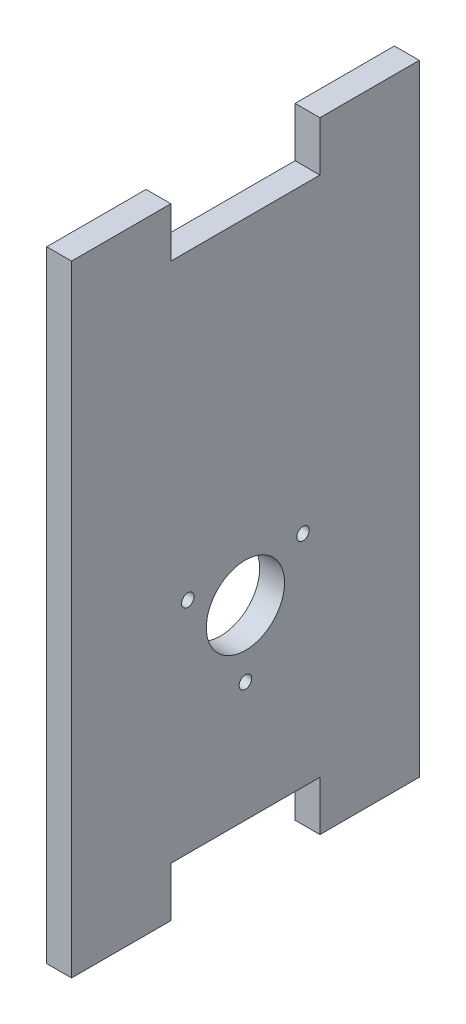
ISO-10303-21;
HEADER;
FILE_DESCRIPTION(('STEP AP214'),'2;1');
FILE_NAME('part.step','',(''),(''),'','','');
FILE_SCHEMA(('AUTOMOTIVE_DESIGN { 1 0 10303 214 1 1 1 1 }'));
ENDSEC;
DATA;
#1=APPLICATION_CONTEXT('core data for automotive mechanical design processes');
#2=APPLICATION_PROTOCOL_DEFINITION('international standard','automotive_design',2000,#1);
#3=PRODUCT_CONTEXT('',#1,'mechanical');
#4=PRODUCT('Part','Part','',(#3));
#5=PRODUCT_RELATED_PRODUCT_CATEGORY('part','',(#4));
#6=PRODUCT_DEFINITION_FORMATION('','',#4);
#7=PRODUCT_DEFINITION_CONTEXT('part definition',#1,'design');
#8=PRODUCT_DEFINITION('design','',#6,#7);
#9=PRODUCT_DEFINITION_SHAPE('','',#8);
#10=(LENGTH_UNIT() NAMED_UNIT(*) SI_UNIT(.MILLI.,.METRE.));
#11=(NAMED_UNIT(*) PLANE_ANGLE_UNIT() SI_UNIT($,.RADIAN.));
#12=(NAMED_UNIT(*) SI_UNIT($,.STERADIAN.) SOLID_ANGLE_UNIT());
#13=UNCERTAINTY_MEASURE_WITH_UNIT(LENGTH_MEASURE(1.E-05),#10,'distance_accuracy_value','');
#14=(GEOMETRIC_REPRESENTATION_CONTEXT(3) GLOBAL_UNCERTAINTY_ASSIGNED_CONTEXT((#13)) GLOBAL_UNIT_ASSIGNED_CONTEXT((#10,
#11,#12)) REPRESENTATION_CONTEXT('',''));
#15=CARTESIAN_POINT('',(0.,0.,0.));
#16=DIRECTION('',(0.,0.,1.));
#17=DIRECTION('',(1.,0.,0.));
#18=AXIS2_PLACEMENT_3D('',#15,#16,#17);
#19=CARTESIAN_POINT('',(3.175,-6.35,22.225));
#20=DIRECTION('',(-1.,0.,0.));
#21=DIRECTION('',(0.,0.,1.));
#22=AXIS2_PLACEMENT_3D('',#19,#20,#21);
#23=PLANE('',#22);
#24=CARTESIAN_POINT('',(3.175,28.0625,7.36121593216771));
#25=DIRECTION('',(1.,0.,0.));
#26=DIRECTION('',(0.,0.,-1.));
#27=AXIS2_PLACEMENT_3D('',#24,#25,#26);
#28=CIRCLE('',#27,0.800000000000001);
#29=CARTESIAN_POINT('',(3.175,28.0625,6.56121593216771));
#30=VERTEX_POINT('',#29);
#31=EDGE_CURVE('E290',#30,#30,#28,.T.);
#32=ORIENTED_EDGE('',*,*,#31,.F.);
#33=EDGE_LOOP('',(#32));
#34=FACE_BOUND('',#33,.T.);
#35=CARTESIAN_POINT('',(3.175,23.8125,0.));
#36=DIRECTION('',(1.,0.,0.));
#37=DIRECTION('',(0.,0.,-1.));
#38=AXIS2_PLACEMENT_3D('',#35,#36,#37);
#39=CIRCLE('',#38,5.);
#40=CARTESIAN_POINT('',(3.175,23.8125,-5.));
#41=VERTEX_POINT('',#40);
#42=EDGE_CURVE('E156',#41,#41,#39,.T.);
#43=ORIENTED_EDGE('',*,*,#42,.F.);
#44=EDGE_LOOP('',(#43));
#45=FACE_BOUND('',#44,.T.);
#46=DIRECTION('',(0.,-1.,0.));
#47=VECTOR('',#46,1.);
#48=CARTESIAN_POINT('',(3.175,73.025,22.225));
#49=LINE('',#48,#47);
#50=CARTESIAN_POINT('',(3.175,73.025,22.225));
#51=VERTEX_POINT('',#50);
#52=CARTESIAN_POINT('',(3.175,-6.35,22.225));
#53=VERTEX_POINT('',#52);
#54=EDGE_CURVE('E175',#51,#53,#49,.T.);
#55=ORIENTED_EDGE('',*,*,#54,.T.);
#56=DIRECTION('',(0.,0.,-1.));
#57=VECTOR('',#56,1.);
#58=CARTESIAN_POINT('',(3.175,-6.35,9.525));
#59=LINE('',#58,#57);
#60=CARTESIAN_POINT('',(3.175,-6.35,9.525));
#61=VERTEX_POINT('',#60);
#62=EDGE_CURVE('E103',#53,#61,#59,.T.);
#63=ORIENTED_EDGE('',*,*,#62,.T.);
#64=DIRECTION('',(0.,1.,0.));
#65=VECTOR('',#64,1.);
#66=CARTESIAN_POINT('',(3.175,0.,9.525));
#67=LINE('',#66,#65);
#68=CARTESIAN_POINT('',(3.175,0.,9.525));
#69=VERTEX_POINT('',#68);
#70=EDGE_CURVE('E202',#61,#69,#67,.T.);
#71=ORIENTED_EDGE('',*,*,#70,.T.);
#72=DIRECTION('',(0.,0.,-1.));
#73=VECTOR('',#72,1.);
#74=CARTESIAN_POINT('',(3.175,0.,9.525));
#75=LINE('',#74,#73);
#76=CARTESIAN_POINT('',(3.175,0.,-9.525));
#77=VERTEX_POINT('',#76);
#78=EDGE_CURVE('E221',#69,#77,#75,.T.);
#79=ORIENTED_EDGE('',*,*,#78,.T.);
#80=DIRECTION('',(0.,-1.,0.));
#81=VECTOR('',#80,1.);
#82=CARTESIAN_POINT('',(3.175,0.,-9.525));
#83=LINE('',#82,#81);
#84=CARTESIAN_POINT('',(3.175,-6.35,-9.525));
#85=VERTEX_POINT('',#84);
#86=EDGE_CURVE('E218',#77,#85,#83,.T.);
#87=ORIENTED_EDGE('',*,*,#86,.T.);
#88=DIRECTION('',(0.,0.,-1.));
#89=VECTOR('',#88,1.);
#90=CARTESIAN_POINT('',(3.175,-6.35,-9.525));
#91=LINE('',#90,#89);
#92=CARTESIAN_POINT('',(3.175,-6.35,-22.225));
#93=VERTEX_POINT('',#92);
#94=EDGE_CURVE('E220',#85,#93,#91,.T.);
#95=ORIENTED_EDGE('',*,*,#94,.T.);
#96=DIRECTION('',(0.,1.,0.));
#97=VECTOR('',#96,1.);
#98=CARTESIAN_POINT('',(3.175,73.025,-22.225));
#99=LINE('',#98,#97);
#100=CARTESIAN_POINT('',(3.175,73.025,-22.225));
#101=VERTEX_POINT('',#100);
#102=EDGE_CURVE('E223',#93,#101,#99,.T.);
#103=ORIENTED_EDGE('',*,*,#102,.T.);
#104=DIRECTION('',(0.,0.,1.));
#105=VECTOR('',#104,1.);
#106=CARTESIAN_POINT('',(3.175,73.025,-22.225));
#107=LINE('',#106,#105);
#108=CARTESIAN_POINT('',(3.175,73.025,-9.52500000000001));
#109=VERTEX_POINT('',#108);
#110=EDGE_CURVE('E229',#101,#109,#107,.T.);
#111=ORIENTED_EDGE('',*,*,#110,.T.);
#112=DIRECTION('',(0.,-1.,0.));
#113=VECTOR('',#112,1.);
#114=CARTESIAN_POINT('',(3.175,73.025,-9.52500000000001));
#115=LINE('',#114,#113);
#116=CARTESIAN_POINT('',(3.175,66.675,-9.52500000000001));
#117=VERTEX_POINT('',#116);
#118=EDGE_CURVE('E134',#109,#117,#115,.T.);
#119=ORIENTED_EDGE('',*,*,#118,.T.);
#120=DIRECTION('',(0.,0.,1.));
#121=VECTOR('',#120,1.);
#122=CARTESIAN_POINT('',(3.175,66.675,9.52500000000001));
#123=LINE('',#122,#121);
#124=CARTESIAN_POINT('',(3.175,66.675,9.52500000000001));
#125=VERTEX_POINT('',#124);
#126=EDGE_CURVE('E128',#117,#125,#123,.T.);
#127=ORIENTED_EDGE('',*,*,#126,.T.);
#128=DIRECTION('',(0.,1.,0.));
#129=VECTOR('',#128,1.);
#130=CARTESIAN_POINT('',(3.175,73.025,9.52500000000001));
#131=LINE('',#130,#129);
#132=CARTESIAN_POINT('',(3.175,73.025,9.52500000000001));
#133=VERTEX_POINT('',#132);
#134=EDGE_CURVE('E132',#125,#133,#131,.T.);
#135=ORIENTED_EDGE('',*,*,#134,.T.);
#136=DIRECTION('',(0.,0.,1.));
#137=VECTOR('',#136,1.);
#138=CARTESIAN_POINT('',(3.175,73.025,22.225));
#139=LINE('',#138,#137);
#140=EDGE_CURVE('E48',#133,#51,#139,.T.);
#141=ORIENTED_EDGE('',*,*,#140,.T.);
#142=EDGE_LOOP('',(#55,#63,#71,#79,#87,#95,#103,#111,#119,#127,#135,#141));
#143=FACE_BOUND('',#142,.T.);
#144=CARTESIAN_POINT('',(3.175,15.3125,0.));
#145=DIRECTION('',(1.,0.,0.));
#146=DIRECTION('',(0.,0.,-1.));
#147=AXIS2_PLACEMENT_3D('',#144,#145,#146);
#148=CIRCLE('',#147,0.8);
#149=CARTESIAN_POINT('',(3.175,15.3125,-0.8));
#150=VERTEX_POINT('',#149);
#151=EDGE_CURVE('E296',#150,#150,#148,.T.);
#152=ORIENTED_EDGE('',*,*,#151,.F.);
#153=EDGE_LOOP('',(#152));
#154=FACE_BOUND('',#153,.T.);
#155=CARTESIAN_POINT('',(3.175,28.0624999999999,-7.36121593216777));
#156=DIRECTION('',(1.,0.,0.));
#157=DIRECTION('',(0.,0.,-1.));
#158=AXIS2_PLACEMENT_3D('',#155,#156,#157);
#159=CIRCLE('',#158,0.800000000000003);
#160=CARTESIAN_POINT('',(3.175,28.0624999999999,-8.16121593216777));
#161=VERTEX_POINT('',#160);
#162=EDGE_CURVE('E281',#161,#161,#159,.T.);
#163=ORIENTED_EDGE('',*,*,#162,.F.);
#164=EDGE_LOOP('',(#163));
#165=FACE_BOUND('',#164,.T.);
#166=ADVANCED_FACE('F31',(#34,#45,#143,#154,#165),#23,.F.);
#167=CARTESIAN_POINT('',(0.,-6.35,22.225));
#168=DIRECTION('',(-1.,0.,0.));
#169=DIRECTION('',(0.,0.,1.));
#170=AXIS2_PLACEMENT_3D('',#167,#168,#169);
#171=PLANE('',#170);
#172=CARTESIAN_POINT('',(0.,28.0625,7.36121593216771));
#173=DIRECTION('',(1.,0.,0.));
#174=DIRECTION('',(0.,0.,-1.));
#175=AXIS2_PLACEMENT_3D('',#172,#173,#174);
#176=CIRCLE('',#175,0.800000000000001);
#177=CARTESIAN_POINT('',(0.,28.0625,6.56121593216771));
#178=VERTEX_POINT('',#177);
#179=EDGE_CURVE('E287',#178,#178,#176,.T.);
#180=ORIENTED_EDGE('',*,*,#179,.T.);
#181=EDGE_LOOP('',(#180));
#182=FACE_BOUND('',#181,.T.);
#183=CARTESIAN_POINT('',(0.,23.8125,0.));
#184=DIRECTION('',(1.,0.,0.));
#185=DIRECTION('',(0.,0.,-1.));
#186=AXIS2_PLACEMENT_3D('',#183,#184,#185);
#187=CIRCLE('',#186,5.);
#188=CARTESIAN_POINT('',(0.,23.8125,-5.));
#189=VERTEX_POINT('',#188);
#190=EDGE_CURVE('E299',#189,#189,#187,.T.);
#191=ORIENTED_EDGE('',*,*,#190,.T.);
#192=EDGE_LOOP('',(#191));
#193=FACE_BOUND('',#192,.T.);
#194=DIRECTION('',(0.,-1.,0.));
#195=VECTOR('',#194,1.);
#196=CARTESIAN_POINT('',(0.,73.025,22.225));
#197=LINE('',#196,#195);
#198=CARTESIAN_POINT('',(0.,73.025,22.225));
#199=VERTEX_POINT('',#198);
#200=CARTESIAN_POINT('',(0.,-6.35,22.225));
#201=VERTEX_POINT('',#200);
#202=EDGE_CURVE('E152',#199,#201,#197,.T.);
#203=ORIENTED_EDGE('',*,*,#202,.F.);
#204=DIRECTION('',(0.,0.,1.));
#205=VECTOR('',#204,1.);
#206=CARTESIAN_POINT('',(0.,73.025,22.225));
#207=LINE('',#206,#205);
#208=CARTESIAN_POINT('',(0.,73.025,9.52500000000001));
#209=VERTEX_POINT('',#208);
#210=EDGE_CURVE('E95',#209,#199,#207,.T.);
#211=ORIENTED_EDGE('',*,*,#210,.F.);
#212=DIRECTION('',(0.,1.,0.));
#213=VECTOR('',#212,1.);
#214=CARTESIAN_POINT('',(0.,73.025,9.52500000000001));
#215=LINE('',#214,#213);
#216=CARTESIAN_POINT('',(0.,66.675,9.52500000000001));
#217=VERTEX_POINT('',#216);
#218=EDGE_CURVE('E89',#217,#209,#215,.T.);
#219=ORIENTED_EDGE('',*,*,#218,.F.);
#220=DIRECTION('',(0.,0.,1.));
#221=VECTOR('',#220,1.);
#222=CARTESIAN_POINT('',(0.,66.675,9.52500000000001));
#223=LINE('',#222,#221);
#224=CARTESIAN_POINT('',(0.,66.675,-9.52500000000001));
#225=VERTEX_POINT('',#224);
#226=EDGE_CURVE('E142',#225,#217,#223,.T.);
#227=ORIENTED_EDGE('',*,*,#226,.F.);
#228=DIRECTION('',(0.,-1.,0.));
#229=VECTOR('',#228,1.);
#230=CARTESIAN_POINT('',(0.,73.025,-9.52500000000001));
#231=LINE('',#230,#229);
#232=CARTESIAN_POINT('',(0.,73.025,-9.52500000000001));
#233=VERTEX_POINT('',#232);
#234=EDGE_CURVE('E170',#233,#225,#231,.T.);
#235=ORIENTED_EDGE('',*,*,#234,.F.);
#236=DIRECTION('',(0.,0.,1.));
#237=VECTOR('',#236,1.);
#238=CARTESIAN_POINT('',(0.,73.025,-22.225));
#239=LINE('',#238,#237);
#240=CARTESIAN_POINT('',(0.,73.025,-22.225));
#241=VERTEX_POINT('',#240);
#242=EDGE_CURVE('E168',#241,#233,#239,.T.);
#243=ORIENTED_EDGE('',*,*,#242,.F.);
#244=DIRECTION('',(0.,1.,0.));
#245=VECTOR('',#244,1.);
#246=CARTESIAN_POINT('',(0.,73.025,-22.225));
#247=LINE('',#246,#245);
#248=CARTESIAN_POINT('',(0.,-6.35,-22.225));
#249=VERTEX_POINT('',#248);
#250=EDGE_CURVE('E166',#249,#241,#247,.T.);
#251=ORIENTED_EDGE('',*,*,#250,.F.);
#252=DIRECTION('',(0.,0.,-1.));
#253=VECTOR('',#252,1.);
#254=CARTESIAN_POINT('',(0.,-6.35,-9.525));
#255=LINE('',#254,#253);
#256=CARTESIAN_POINT('',(0.,-6.35,-9.525));
#257=VERTEX_POINT('',#256);
#258=EDGE_CURVE('E164',#257,#249,#255,.T.);
#259=ORIENTED_EDGE('',*,*,#258,.F.);
#260=DIRECTION('',(0.,-1.,0.));
#261=VECTOR('',#260,1.);
#262=CARTESIAN_POINT('',(0.,0.,-9.525));
#263=LINE('',#262,#261);
#264=CARTESIAN_POINT('',(0.,0.,-9.525));
#265=VERTEX_POINT('',#264);
#266=EDGE_CURVE('E162',#265,#257,#263,.T.);
#267=ORIENTED_EDGE('',*,*,#266,.F.);
#268=DIRECTION('',(0.,0.,-1.));
#269=VECTOR('',#268,1.);
#270=CARTESIAN_POINT('',(0.,0.,9.525));
#271=LINE('',#270,#269);
#272=CARTESIAN_POINT('',(0.,0.,9.525));
#273=VERTEX_POINT('',#272);
#274=EDGE_CURVE('E160',#273,#265,#271,.T.);
#275=ORIENTED_EDGE('',*,*,#274,.F.);
#276=DIRECTION('',(0.,1.,0.));
#277=VECTOR('',#276,1.);
#278=CARTESIAN_POINT('',(0.,0.,9.525));
#279=LINE('',#278,#277);
#280=CARTESIAN_POINT('',(0.,-6.35,9.525));
#281=VERTEX_POINT('',#280);
#282=EDGE_CURVE('E158',#281,#273,#279,.T.);
#283=ORIENTED_EDGE('',*,*,#282,.F.);
#284=DIRECTION('',(0.,0.,-1.));
#285=VECTOR('',#284,1.);
#286=CARTESIAN_POINT('',(0.,-6.35,9.525));
#287=LINE('',#286,#285);
#288=EDGE_CURVE('E155',#201,#281,#287,.T.);
#289=ORIENTED_EDGE('',*,*,#288,.F.);
#290=EDGE_LOOP('',(#203,#211,#219,#227,#235,#243,#251,#259,#267,#275,#283,#289));
#291=FACE_BOUND('',#290,.T.);
#292=CARTESIAN_POINT('',(0.,15.3125,0.));
#293=DIRECTION('',(1.,0.,0.));
#294=DIRECTION('',(0.,0.,-1.));
#295=AXIS2_PLACEMENT_3D('',#292,#293,#294);
#296=CIRCLE('',#295,0.8);
#297=CARTESIAN_POINT('',(0.,15.3125,-0.8));
#298=VERTEX_POINT('',#297);
#299=EDGE_CURVE('E293',#298,#298,#296,.T.);
#300=ORIENTED_EDGE('',*,*,#299,.T.);
#301=EDGE_LOOP('',(#300));
#302=FACE_BOUND('',#301,.T.);
#303=CARTESIAN_POINT('',(0.,28.0624999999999,-7.36121593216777));
#304=DIRECTION('',(1.,0.,0.));
#305=DIRECTION('',(0.,0.,-1.));
#306=AXIS2_PLACEMENT_3D('',#303,#304,#305);
#307=CIRCLE('',#306,0.800000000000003);
#308=CARTESIAN_POINT('',(0.,28.0624999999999,-8.16121593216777));
#309=VERTEX_POINT('',#308);
#310=EDGE_CURVE('E284',#309,#309,#307,.T.);
#311=ORIENTED_EDGE('',*,*,#310,.T.);
#312=EDGE_LOOP('',(#311));
#313=FACE_BOUND('',#312,.T.);
#314=ADVANCED_FACE('F206',(#182,#193,#291,#302,#313),#171,.T.);
#315=CARTESIAN_POINT('',(3.175,73.025,22.225));
#316=DIRECTION('',(0.,0.,-1.));
#317=DIRECTION('',(0.,1.,0.));
#318=AXIS2_PLACEMENT_3D('',#315,#316,#317);
#319=PLANE('',#318);
#320=ORIENTED_EDGE('',*,*,#202,.T.);
#321=DIRECTION('',(-1.,0.,0.));
#322=VECTOR('',#321,1.);
#323=CARTESIAN_POINT('',(3.175,-6.35,22.225));
#324=LINE('',#323,#322);
#325=EDGE_CURVE('E11',#53,#201,#324,.T.);
#326=ORIENTED_EDGE('',*,*,#325,.F.);
#327=ORIENTED_EDGE('',*,*,#54,.F.);
#328=DIRECTION('',(-1.,0.,0.));
#329=VECTOR('',#328,1.);
#330=CARTESIAN_POINT('',(3.175,73.025,22.225));
#331=LINE('',#330,#329);
#332=EDGE_CURVE('E148',#51,#199,#331,.T.);
#333=ORIENTED_EDGE('',*,*,#332,.T.);
#334=EDGE_LOOP('',(#320,#326,#327,#333));
#335=FACE_BOUND('',#334,.T.);
#336=ADVANCED_FACE('F33',(#335),#319,.F.);
#337=CARTESIAN_POINT('',(3.175,-6.35,9.525));
#338=DIRECTION('',(0.,1.,0.));
#339=DIRECTION('',(0.,0.,1.));
#340=AXIS2_PLACEMENT_3D('',#337,#338,#339);
#341=PLANE('',#340);
#342=ORIENTED_EDGE('',*,*,#288,.T.);
#343=DIRECTION('',(-1.,0.,0.));
#344=VECTOR('',#343,1.);
#345=CARTESIAN_POINT('',(3.175,-6.35,9.525));
#346=LINE('',#345,#344);
#347=EDGE_CURVE('E40',#61,#281,#346,.T.);
#348=ORIENTED_EDGE('',*,*,#347,.F.);
#349=ORIENTED_EDGE('',*,*,#62,.F.);
#350=ORIENTED_EDGE('',*,*,#325,.T.);
#351=EDGE_LOOP('',(#342,#348,#349,#350));
#352=FACE_BOUND('',#351,.T.);
#353=ADVANCED_FACE('F408',(#352),#341,.F.);
#354=CARTESIAN_POINT('',(3.175,0.,9.525));
#355=DIRECTION('',(0.,0.,1.));
#356=DIRECTION('',(1.,0.,0.));
#357=AXIS2_PLACEMENT_3D('',#354,#355,#356);
#358=PLANE('',#357);
#359=ORIENTED_EDGE('',*,*,#282,.T.);
#360=DIRECTION('',(-1.,0.,0.));
#361=VECTOR('',#360,1.);
#362=CARTESIAN_POINT('',(3.175,0.,9.525));
#363=LINE('',#362,#361);
#364=EDGE_CURVE('E194',#69,#273,#363,.T.);
#365=ORIENTED_EDGE('',*,*,#364,.F.);
#366=ORIENTED_EDGE('',*,*,#70,.F.);
#367=ORIENTED_EDGE('',*,*,#347,.T.);
#368=EDGE_LOOP('',(#359,#365,#366,#367));
#369=FACE_BOUND('',#368,.T.);
#370=ADVANCED_FACE('F200',(#369),#358,.F.);
#371=CARTESIAN_POINT('',(3.175,0.,9.525));
#372=DIRECTION('',(0.,1.,0.));
#373=DIRECTION('',(0.,0.,1.));
#374=AXIS2_PLACEMENT_3D('',#371,#372,#373);
#375=PLANE('',#374);
#376=ORIENTED_EDGE('',*,*,#274,.T.);
#377=DIRECTION('',(-1.,0.,0.));
#378=VECTOR('',#377,1.);
#379=CARTESIAN_POINT('',(3.175,0.,-9.525));
#380=LINE('',#379,#378);
#381=EDGE_CURVE('E191',#77,#265,#380,.T.);
#382=ORIENTED_EDGE('',*,*,#381,.F.);
#383=ORIENTED_EDGE('',*,*,#78,.F.);
#384=ORIENTED_EDGE('',*,*,#364,.T.);
#385=EDGE_LOOP('',(#376,#382,#383,#384));
#386=FACE_BOUND('',#385,.T.);
#387=ADVANCED_FACE('F212',(#386),#375,.F.);
#388=CARTESIAN_POINT('',(3.175,0.,-9.525));
#389=DIRECTION('',(0.,0.,-1.));
#390=DIRECTION('',(-1.,0.,0.));
#391=AXIS2_PLACEMENT_3D('',#388,#389,#390);
#392=PLANE('',#391);
#393=ORIENTED_EDGE('',*,*,#266,.T.);
#394=DIRECTION('',(-1.,0.,0.));
#395=VECTOR('',#394,1.);
#396=CARTESIAN_POINT('',(3.175,-6.35,-9.525));
#397=LINE('',#396,#395);
#398=EDGE_CURVE('E188',#85,#257,#397,.T.);
#399=ORIENTED_EDGE('',*,*,#398,.F.);
#400=ORIENTED_EDGE('',*,*,#86,.F.);
#401=ORIENTED_EDGE('',*,*,#381,.T.);
#402=EDGE_LOOP('',(#393,#399,#400,#401));
#403=FACE_BOUND('',#402,.T.);
#404=ADVANCED_FACE('F216',(#403),#392,.F.);
#405=CARTESIAN_POINT('',(3.175,-6.35,-9.525));
#406=DIRECTION('',(0.,1.,0.));
#407=DIRECTION('',(0.,0.,1.));
#408=AXIS2_PLACEMENT_3D('',#405,#406,#407);
#409=PLANE('',#408);
#410=ORIENTED_EDGE('',*,*,#258,.T.);
#411=DIRECTION('',(-1.,0.,0.));
#412=VECTOR('',#411,1.);
#413=CARTESIAN_POINT('',(3.175,-6.35,-22.225));
#414=LINE('',#413,#412);
#415=EDGE_CURVE('E185',#93,#249,#414,.T.);
#416=ORIENTED_EDGE('',*,*,#415,.F.);
#417=ORIENTED_EDGE('',*,*,#94,.F.);
#418=ORIENTED_EDGE('',*,*,#398,.T.);
#419=EDGE_LOOP('',(#410,#416,#417,#418));
#420=FACE_BOUND('',#419,.T.);
#421=ADVANCED_FACE('F373',(#420),#409,.F.);
#422=CARTESIAN_POINT('',(3.175,73.025,-22.225));
#423=DIRECTION('',(0.,0.,1.));
#424=DIRECTION('',(0.,-1.,0.));
#425=AXIS2_PLACEMENT_3D('',#422,#423,#424);
#426=PLANE('',#425);
#427=ORIENTED_EDGE('',*,*,#250,.T.);
#428=DIRECTION('',(-1.,0.,0.));
#429=VECTOR('',#428,1.);
#430=CARTESIAN_POINT('',(3.175,73.025,-22.225));
#431=LINE('',#430,#429);
#432=EDGE_CURVE('E182',#101,#241,#431,.T.);
#433=ORIENTED_EDGE('',*,*,#432,.F.);
#434=ORIENTED_EDGE('',*,*,#102,.F.);
#435=ORIENTED_EDGE('',*,*,#415,.T.);
#436=EDGE_LOOP('',(#427,#433,#434,#435));
#437=FACE_BOUND('',#436,.T.);
#438=ADVANCED_FACE('F364',(#437),#426,.F.);
#439=CARTESIAN_POINT('',(3.175,73.025,-22.225));
#440=DIRECTION('',(0.,-1.,0.));
#441=DIRECTION('',(0.,0.,-1.));
#442=AXIS2_PLACEMENT_3D('',#439,#440,#441);
#443=PLANE('',#442);
#444=ORIENTED_EDGE('',*,*,#242,.T.);
#445=DIRECTION('',(-1.,0.,0.));
#446=VECTOR('',#445,1.);
#447=CARTESIAN_POINT('',(3.175,73.025,-9.52500000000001));
#448=LINE('',#447,#446);
#449=EDGE_CURVE('E179',#109,#233,#448,.T.);
#450=ORIENTED_EDGE('',*,*,#449,.F.);
#451=ORIENTED_EDGE('',*,*,#110,.F.);
#452=ORIENTED_EDGE('',*,*,#432,.T.);
#453=EDGE_LOOP('',(#444,#450,#451,#452));
#454=FACE_BOUND('',#453,.T.);
#455=ADVANCED_FACE('F235',(#454),#443,.F.);
#456=CARTESIAN_POINT('',(3.175,73.025,-9.52500000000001));
#457=DIRECTION('',(0.,0.,-1.));
#458=DIRECTION('',(-1.,0.,0.));
#459=AXIS2_PLACEMENT_3D('',#456,#457,#458);
#460=PLANE('',#459);
#461=ORIENTED_EDGE('',*,*,#234,.T.);
#462=DIRECTION('',(-1.,0.,0.));
#463=VECTOR('',#462,1.);
#464=CARTESIAN_POINT('',(3.175,66.675,-9.52500000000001));
#465=LINE('',#464,#463);
#466=EDGE_CURVE('E143',#117,#225,#465,.T.);
#467=ORIENTED_EDGE('',*,*,#466,.F.);
#468=ORIENTED_EDGE('',*,*,#118,.F.);
#469=ORIENTED_EDGE('',*,*,#449,.T.);
#470=EDGE_LOOP('',(#461,#467,#468,#469));
#471=FACE_BOUND('',#470,.T.);
#472=ADVANCED_FACE('F239',(#471),#460,.F.);
#473=CARTESIAN_POINT('',(3.175,66.675,9.52500000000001));
#474=DIRECTION('',(0.,-1.,0.));
#475=DIRECTION('',(0.,0.,-1.));
#476=AXIS2_PLACEMENT_3D('',#473,#474,#475);
#477=PLANE('',#476);
#478=ORIENTED_EDGE('',*,*,#226,.T.);
#479=DIRECTION('',(-1.,0.,0.));
#480=VECTOR('',#479,1.);
#481=CARTESIAN_POINT('',(3.175,66.675,9.52500000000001));
#482=LINE('',#481,#480);
#483=EDGE_CURVE('E139',#125,#217,#482,.T.);
#484=ORIENTED_EDGE('',*,*,#483,.F.);
#485=ORIENTED_EDGE('',*,*,#126,.F.);
#486=ORIENTED_EDGE('',*,*,#466,.T.);
#487=EDGE_LOOP('',(#478,#484,#485,#486));
#488=FACE_BOUND('',#487,.T.);
#489=ADVANCED_FACE('F140',(#488),#477,.F.);
#490=CARTESIAN_POINT('',(3.175,73.025,9.52500000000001));
#491=DIRECTION('',(0.,0.,1.));
#492=DIRECTION('',(1.,0.,0.));
#493=AXIS2_PLACEMENT_3D('',#490,#491,#492);
#494=PLANE('',#493);
#495=ORIENTED_EDGE('',*,*,#218,.T.);
#496=DIRECTION('',(-1.,0.,0.));
#497=VECTOR('',#496,1.);
#498=CARTESIAN_POINT('',(3.175,73.025,9.52500000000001));
#499=LINE('',#498,#497);
#500=EDGE_CURVE('E144',#133,#209,#499,.T.);
#501=ORIENTED_EDGE('',*,*,#500,.F.);
#502=ORIENTED_EDGE('',*,*,#134,.F.);
#503=ORIENTED_EDGE('',*,*,#483,.T.);
#504=EDGE_LOOP('',(#495,#501,#502,#503));
#505=FACE_BOUND('',#504,.T.);
#506=ADVANCED_FACE('F146',(#505),#494,.F.);
#507=CARTESIAN_POINT('',(3.175,73.025,22.225));
#508=DIRECTION('',(0.,-1.,0.));
#509=DIRECTION('',(0.,0.,-1.));
#510=AXIS2_PLACEMENT_3D('',#507,#508,#509);
#511=PLANE('',#510);
#512=ORIENTED_EDGE('',*,*,#210,.T.);
#513=ORIENTED_EDGE('',*,*,#332,.F.);
#514=ORIENTED_EDGE('',*,*,#140,.F.);
#515=ORIENTED_EDGE('',*,*,#500,.T.);
#516=EDGE_LOOP('',(#512,#513,#514,#515));
#517=FACE_BOUND('',#516,.T.);
#518=ADVANCED_FACE('F243',(#517),#511,.F.);
#519=CARTESIAN_POINT('',(3.175,23.8125,0.));
#520=DIRECTION('',(-1.,0.,0.));
#521=DIRECTION('',(0.,0.,1.));
#522=AXIS2_PLACEMENT_3D('',#519,#520,#521);
#523=CYLINDRICAL_SURFACE('',#522,5.);
#524=ORIENTED_EDGE('',*,*,#42,.T.);
#525=EDGE_LOOP('',(#524));
#526=FACE_BOUND('',#525,.T.);
#527=ORIENTED_EDGE('',*,*,#190,.F.);
#528=EDGE_LOOP('',(#527));
#529=FACE_BOUND('',#528,.T.);
#530=ADVANCED_FACE('F245',(#526,#529),#523,.F.);
#531=CARTESIAN_POINT('',(3.175,15.3125,0.));
#532=DIRECTION('',(-1.,0.,0.));
#533=DIRECTION('',(0.,0.,1.));
#534=AXIS2_PLACEMENT_3D('',#531,#532,#533);
#535=CYLINDRICAL_SURFACE('',#534,0.8);
#536=ORIENTED_EDGE('',*,*,#151,.T.);
#537=EDGE_LOOP('',(#536));
#538=FACE_BOUND('',#537,.T.);
#539=ORIENTED_EDGE('',*,*,#299,.F.);
#540=EDGE_LOOP('',(#539));
#541=FACE_BOUND('',#540,.T.);
#542=ADVANCED_FACE('F251',(#538,#541),#535,.F.);
#543=CARTESIAN_POINT('',(3.175,28.0625,7.36121593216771));
#544=DIRECTION('',(-1.,0.,0.));
#545=DIRECTION('',(0.,0.,1.));
#546=AXIS2_PLACEMENT_3D('',#543,#544,#545);
#547=CYLINDRICAL_SURFACE('',#546,0.800000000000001);
#548=ORIENTED_EDGE('',*,*,#31,.T.);
#549=EDGE_LOOP('',(#548));
#550=FACE_BOUND('',#549,.T.);
#551=ORIENTED_EDGE('',*,*,#179,.F.);
#552=EDGE_LOOP('',(#551));
#553=FACE_BOUND('',#552,.T.);
#554=ADVANCED_FACE('F268',(#550,#553),#547,.F.);
#555=CARTESIAN_POINT('',(3.175,28.0624999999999,-7.36121593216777));
#556=DIRECTION('',(-1.,0.,0.));
#557=DIRECTION('',(0.,0.,1.));
#558=AXIS2_PLACEMENT_3D('',#555,#556,#557);
#559=CYLINDRICAL_SURFACE('',#558,0.800000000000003);
#560=ORIENTED_EDGE('',*,*,#162,.T.);
#561=EDGE_LOOP('',(#560));
#562=FACE_BOUND('',#561,.T.);
#563=ORIENTED_EDGE('',*,*,#310,.F.);
#564=EDGE_LOOP('',(#563));
#565=FACE_BOUND('',#564,.T.);
#566=ADVANCED_FACE('F272',(#562,#565),#559,.F.);
#567=CLOSED_SHELL('',(#166,#314,#336,#353,#370,#387,#404,#421,#438,#455,#472,#489,#506,#518,
#530,#542,#554,#566));
#568=MANIFOLD_SOLID_BREP('B2',#567);
#569=ADVANCED_BREP_SHAPE_REPRESENTATION('',(#18,#568),#14);
#570=SHAPE_DEFINITION_REPRESENTATION(#9,#569);
ENDSEC;
END-ISO-10303-21;
